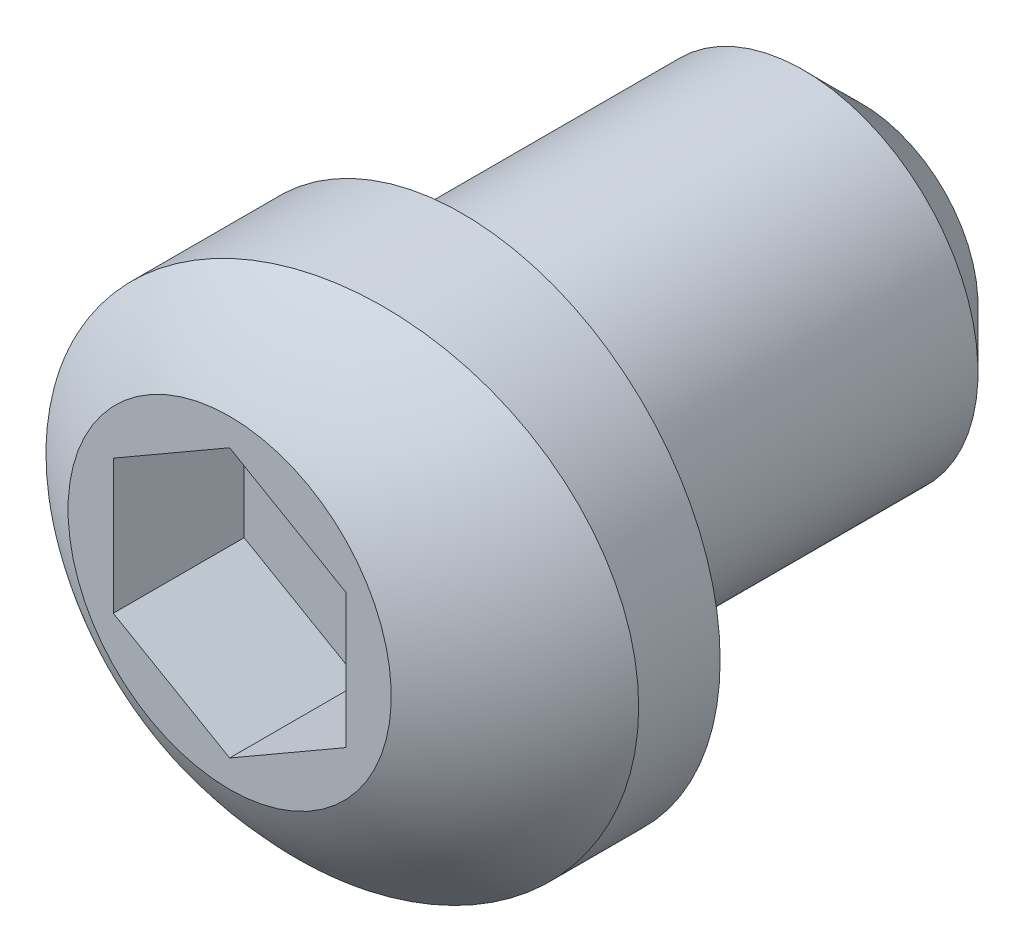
ISO-10303-21;
HEADER;
FILE_DESCRIPTION(('STEP AP214'),'2;1');
FILE_NAME('part.step','',(''),(''),'','','');
FILE_SCHEMA(('AUTOMOTIVE_DESIGN { 1 0 10303 214 1 1 1 1 }'));
ENDSEC;
DATA;
#1=APPLICATION_CONTEXT('core data for automotive mechanical design processes');
#2=APPLICATION_PROTOCOL_DEFINITION('international standard','automotive_design',2000,#1);
#3=PRODUCT_CONTEXT('',#1,'mechanical');
#4=PRODUCT('Part','Part','',(#3));
#5=PRODUCT_RELATED_PRODUCT_CATEGORY('part','',(#4));
#6=PRODUCT_DEFINITION_FORMATION('','',#4);
#7=PRODUCT_DEFINITION_CONTEXT('part definition',#1,'design');
#8=PRODUCT_DEFINITION('design','',#6,#7);
#9=PRODUCT_DEFINITION_SHAPE('','',#8);
#10=(LENGTH_UNIT() NAMED_UNIT(*) SI_UNIT(.MILLI.,.METRE.));
#11=(NAMED_UNIT(*) PLANE_ANGLE_UNIT() SI_UNIT($,.RADIAN.));
#12=(NAMED_UNIT(*) SI_UNIT($,.STERADIAN.) SOLID_ANGLE_UNIT());
#13=UNCERTAINTY_MEASURE_WITH_UNIT(LENGTH_MEASURE(1.E-05),#10,'distance_accuracy_value','');
#14=(GEOMETRIC_REPRESENTATION_CONTEXT(3) GLOBAL_UNCERTAINTY_ASSIGNED_CONTEXT((#13)) GLOBAL_UNIT_ASSIGNED_CONTEXT((#10,
#11,#12)) REPRESENTATION_CONTEXT('',''));
#15=CARTESIAN_POINT('',(0.,0.,0.));
#16=DIRECTION('',(0.,0.,1.));
#17=DIRECTION('',(1.,0.,0.));
#18=AXIS2_PLACEMENT_3D('',#15,#16,#17);
#19=CARTESIAN_POINT('',(0.,0.,-4.37516087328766));
#20=DIRECTION('',(0.,0.,1.));
#21=DIRECTION('',(0.,-1.,0.));
#22=AXIS2_PLACEMENT_3D('',#19,#20,#21);
#23=SPHERICAL_SURFACE('',#22,12.4184831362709);
#24=CARTESIAN_POINT('',(0.,0.,6.731));
#25=DIRECTION('',(0.,0.,1.));
#26=DIRECTION('',(-1.,0.,0.));
#27=AXIS2_PLACEMENT_3D('',#24,#25,#26);
#28=CIRCLE('',#27,5.55625);
#29=CARTESIAN_POINT('',(0.,-5.55625,6.731));
#30=VERTEX_POINT('',#29);
#31=EDGE_CURVE('E133',#30,#30,#28,.T.);
#32=CARTESIAN_POINT('',(7.48506717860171,6.32092343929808,3.25624919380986));
#33=CARTESIAN_POINT('',(7.30574546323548,6.49724383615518,3.28609149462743));
#34=CARTESIAN_POINT('',(7.11902177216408,6.66582353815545,3.31699013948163));
#35=CARTESIAN_POINT('',(6.7320528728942,6.98643352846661,3.38061683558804));
#36=CARTESIAN_POINT('',(6.53180370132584,7.13845893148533,3.41334542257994));
#37=CARTESIAN_POINT('',(6.11905439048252,7.42502558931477,3.48036050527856));
#38=CARTESIAN_POINT('',(5.90653995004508,7.5595458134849,3.51464880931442));
#39=CARTESIAN_POINT('',(5.47100369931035,7.8099810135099,3.58444707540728));
#40=CARTESIAN_POINT('',(5.24798168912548,7.92589563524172,3.61995706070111));
#41=CARTESIAN_POINT('',(4.79322257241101,8.13824042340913,3.69187059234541));
#42=CARTESIAN_POINT('',(4.56149302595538,8.23468704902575,3.72827335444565));
#43=CARTESIAN_POINT('',(4.09077897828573,8.40756831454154,3.80171261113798));
#44=CARTESIAN_POINT('',(3.85179435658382,8.48400262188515,3.83874911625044));
#45=CARTESIAN_POINT('',(3.36837048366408,8.61630701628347,3.91315697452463));
#46=CARTESIAN_POINT('',(3.12393377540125,8.67218648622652,3.95052816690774));
#47=CARTESIAN_POINT('',(2.63113219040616,8.76306181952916,4.02536382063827));
#48=CARTESIAN_POINT('',(2.38276596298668,8.79805033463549,4.06282831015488));
#49=CARTESIAN_POINT('',(1.88280237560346,8.84697581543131,4.13774590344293));
#50=CARTESIAN_POINT('',(1.63119546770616,8.86081653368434,4.17519818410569));
#51=CARTESIAN_POINT('',(1.12753709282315,8.86703411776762,4.24968311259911));
#52=CARTESIAN_POINT('',(0.875485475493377,8.85940119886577,4.28671556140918));
#53=CARTESIAN_POINT('',(0.372834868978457,8.82268284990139,4.36010307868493));
#54=CARTESIAN_POINT('',(0.122235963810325,8.79359619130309,4.39645810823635));
#55=CARTESIAN_POINT('',(-0.375585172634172,8.71416588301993,4.46824143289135));
#56=CARTESIAN_POINT('',(-0.622808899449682,8.66383198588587,4.50367014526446));
#57=CARTESIAN_POINT('',(-1.11210385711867,8.54226151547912,4.57338362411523));
#58=CARTESIAN_POINT('',(-1.35417742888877,8.4710346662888,4.60766891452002));
#59=CARTESIAN_POINT('',(-1.8314527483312,8.30816947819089,4.67489491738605));
#60=CARTESIAN_POINT('',(-2.06665692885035,8.21653846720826,4.7078361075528));
#61=CARTESIAN_POINT('',(-2.52860665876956,8.01345063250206,4.77219869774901));
#62=CARTESIAN_POINT('',(-2.7553508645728,7.90199067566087,4.80361985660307));
#63=CARTESIAN_POINT('',(-3.19867480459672,7.66001628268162,4.86475572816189));
#64=CARTESIAN_POINT('',(-3.4152545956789,7.52950195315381,4.89447045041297));
#65=CARTESIAN_POINT('',(-3.83526291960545,7.25123896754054,4.95183626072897));
#66=CARTESIAN_POINT('',(-4.03876840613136,7.10360898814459,4.97949960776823));
#67=CARTESIAN_POINT('',(-4.432665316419,6.7914570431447,5.03282356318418));
#68=CARTESIAN_POINT('',(-4.62305678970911,6.62693514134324,5.05848417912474));
#69=CARTESIAN_POINT('',(-4.98930428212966,6.28215673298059,5.10766190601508));
#70=CARTESIAN_POINT('',(-5.16516082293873,6.10190079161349,5.13117909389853));
#71=CARTESIAN_POINT('',(-5.50102820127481,5.72692434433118,5.17594393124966));
#72=CARTESIAN_POINT('',(-5.66103913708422,5.53220392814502,5.19719159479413));
#73=CARTESIAN_POINT('',(-5.96265693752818,5.13148451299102,5.23712470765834));
#74=CARTESIAN_POINT('',(-6.10441512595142,4.92560150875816,5.25583130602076));
#75=CARTESIAN_POINT('',(-6.3701226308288,4.50245176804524,5.29080558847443));
#76=CARTESIAN_POINT('',(-6.49407210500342,4.28518513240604,5.30707329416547));
#77=CARTESIAN_POINT('',(-6.72322799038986,3.84082411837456,5.3370847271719));
#78=CARTESIAN_POINT('',(-6.8284350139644,3.61373006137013,5.35082853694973));
#79=CARTESIAN_POINT('',(-7.01931592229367,3.15133844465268,5.37572153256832));
#80=CARTESIAN_POINT('',(-7.10498989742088,2.91604092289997,5.38687073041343));
#81=CARTESIAN_POINT('',(-7.25555500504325,2.44083489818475,5.40643894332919));
#82=CARTESIAN_POINT('',(-7.32060555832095,2.20097775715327,5.41487890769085));
#83=CARTESIAN_POINT('',(-7.43035461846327,1.71657617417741,5.42910562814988));
#84=CARTESIAN_POINT('',(-7.47505334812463,1.47203178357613,5.4348924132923));
#85=CARTESIAN_POINT('',(-7.5437626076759,0.980011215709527,5.44378342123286));
#86=CARTESIAN_POINT('',(-7.56777361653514,0.732535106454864,5.4468877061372));
#87=CARTESIAN_POINT('',(-7.5949283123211,0.236421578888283,5.45039820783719));
#88=CARTESIAN_POINT('',(-7.59807203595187,-0.0122158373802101,5.45080442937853));
#89=CARTESIAN_POINT('',(-7.58350264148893,-0.507711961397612,5.44892116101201));
#90=CARTESIAN_POINT('',(-7.56588628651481,-0.754573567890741,5.44664417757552));
#91=CARTESIAN_POINT('',(-7.51007833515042,-1.24600712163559,5.43942532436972));
#92=CARTESIAN_POINT('',(-7.47187964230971,-1.49057824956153,5.43448253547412));
#93=CARTESIAN_POINT('',(-7.37519663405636,-1.97555954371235,5.42195752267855));
#94=CARTESIAN_POINT('',(-7.31671619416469,-2.21597049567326,5.4143758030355));
#95=CARTESIAN_POINT('',(-7.17990200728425,-2.69098099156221,5.39661072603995));
#96=CARTESIAN_POINT('',(-7.10156789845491,-2.92558042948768,5.38642732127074));
#97=CARTESIAN_POINT('',(-6.9256085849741,-3.38735834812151,5.36350778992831));
#98=CARTESIAN_POINT('',(-6.82797921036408,-3.61453521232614,5.35077111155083));
#99=CARTESIAN_POINT('',(-6.61415874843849,-4.05982462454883,5.32281050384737));
#100=CARTESIAN_POINT('',(-6.49796726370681,-4.27793697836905,5.30758652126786));
#101=CARTESIAN_POINT('',(-6.24789922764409,-4.7035338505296,5.27473156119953));
#102=CARTESIAN_POINT('',(-6.11402573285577,-4.91102019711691,5.2571009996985));
#103=CARTESIAN_POINT('',(-5.82950618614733,-5.31403901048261,5.21951416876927));
#104=CARTESIAN_POINT('',(-5.67885431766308,-5.5095672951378,5.19955709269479));
#105=CARTESIAN_POINT('',(-5.36117018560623,-5.8881284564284,5.1573262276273));
#106=CARTESIAN_POINT('',(-5.19406492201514,-6.07109891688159,5.1350420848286));
#107=CARTESIAN_POINT('',(-4.84527754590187,-6.42228636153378,5.08835010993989));
#108=CARTESIAN_POINT('',(-4.66359508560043,-6.59050299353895,5.06394222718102));
#109=CARTESIAN_POINT('',(-4.28696641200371,-6.91103503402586,5.01313131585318));
#110=CARTESIAN_POINT('',(-4.09202013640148,-7.0633503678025,4.98672827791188));
#111=CARTESIAN_POINT('',(-3.69025509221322,-7.35105793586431,4.93206669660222));
#112=CARTESIAN_POINT('',(-3.48343599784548,-7.48644970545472,4.90380810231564));
#113=CARTESIAN_POINT('',(-3.05772356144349,-7.74040412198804,4.84535802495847));
#114=CARTESIAN_POINT('',(-2.8387478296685,-7.85882556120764,4.81515305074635));
#115=CARTESIAN_POINT('',(-2.39172568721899,-8.0768035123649,4.75317052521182));
#116=CARTESIAN_POINT('',(-2.16367633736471,-8.1763538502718,4.72139246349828));
#117=CARTESIAN_POINT('',(-1.70022242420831,-8.35587568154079,4.65645631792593));
#118=CARTESIAN_POINT('',(-1.46481879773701,-8.43584965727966,4.62329840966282));
#119=CARTESIAN_POINT('',(-0.988286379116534,-8.57571797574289,4.55578963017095));
#120=CARTESIAN_POINT('',(-0.747157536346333,-8.63561214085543,4.52143874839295));
#121=CARTESIAN_POINT('',(-0.258679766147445,-8.73538597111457,4.45143375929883));
#122=CARTESIAN_POINT('',(-0.0112944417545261,-8.77508123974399,4.41577072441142));
#123=CARTESIAN_POINT('',(0.485754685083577,-8.83338485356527,4.34366774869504));
#124=CARTESIAN_POINT('',(0.735417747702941,-8.85199981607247,4.30722805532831));
#125=CARTESIAN_POINT('',(1.23539359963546,-8.86806104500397,4.23378442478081));
#126=CARTESIAN_POINT('',(1.48570651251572,-8.86550293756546,4.19678037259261));
#127=CARTESIAN_POINT('',(1.98516826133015,-8.83924232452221,4.12245900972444));
#128=CARTESIAN_POINT('',(2.23431711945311,-8.81554022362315,4.08514170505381));
#129=CARTESIAN_POINT('',(2.73128579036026,-8.74694780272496,4.01020953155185));
#130=CARTESIAN_POINT('',(2.9790871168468,-8.70192389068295,3.97259427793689));
#131=CARTESIAN_POINT('',(3.4699884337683,-8.59095501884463,3.8975730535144));
#132=CARTESIAN_POINT('',(3.71308849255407,-8.52501036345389,3.86016707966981));
#133=CARTESIAN_POINT('',(4.19291431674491,-8.3726387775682,3.78583596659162));
#134=CARTESIAN_POINT('',(4.42963877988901,-8.28620769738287,3.74891092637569));
#135=CARTESIAN_POINT('',(4.89489283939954,-8.09349508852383,3.67585126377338));
#136=CARTESIAN_POINT('',(5.12342527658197,-7.98722052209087,3.63971636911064));
#137=CARTESIAN_POINT('',(5.57090706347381,-7.75544115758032,3.56849416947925));
#138=CARTESIAN_POINT('',(5.78984936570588,-7.62992251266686,3.53340764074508));
#139=CARTESIAN_POINT('',(6.21638668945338,-7.3605713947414,3.46461280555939));
#140=CARTESIAN_POINT('',(6.42398195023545,-7.21673930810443,3.43090447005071));
#141=CARTESIAN_POINT('',(6.82631515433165,-6.91174499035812,3.36517052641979));
#142=CARTESIAN_POINT('',(7.02105297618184,-6.75058259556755,3.33314493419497));
#143=CARTESIAN_POINT('',(7.39622385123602,-6.4120473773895,3.27108296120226));
#144=CARTESIAN_POINT('',(7.57665730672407,-6.23467501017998,3.24104652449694));
#145=CARTESIAN_POINT('',(7.92066370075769,-5.86624925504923,3.18346518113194));
#146=CARTESIAN_POINT('',(8.0843457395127,-5.67530023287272,3.15590431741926));
#147=CARTESIAN_POINT('',(8.39499093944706,-5.28003753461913,3.10333524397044));
#148=CARTESIAN_POINT('',(8.54196018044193,-5.07572876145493,3.0783261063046));
#149=CARTESIAN_POINT('',(8.81814563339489,-4.65509835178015,3.03111740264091));
#150=CARTESIAN_POINT('',(8.94735958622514,-4.43877519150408,3.00891819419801));
#151=CARTESIAN_POINT('',(9.18701075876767,-3.99568662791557,2.96758455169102));
#152=CARTESIAN_POINT('',(9.29744816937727,-3.76892133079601,2.94845008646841));
#153=CARTESIAN_POINT('',(9.49736117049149,-3.30961784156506,2.91369988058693));
#154=CARTESIAN_POINT('',(9.58709214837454,-3.07719402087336,2.89804137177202));
#155=CARTESIAN_POINT('',(9.74672396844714,-2.60543502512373,2.87011390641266));
#156=CARTESIAN_POINT('',(9.81662497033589,-2.36609990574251,2.85784492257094));
#157=CARTESIAN_POINT('',(9.93604121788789,-1.88227099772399,2.83684689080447));
#158=CARTESIAN_POINT('',(9.98555862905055,-1.63777775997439,2.82811746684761));
#159=CARTESIAN_POINT('',(10.0638251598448,-1.14538805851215,2.81430518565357));
#160=CARTESIAN_POINT('',(10.0925744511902,-0.897491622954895,2.80922229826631));
#161=CARTESIAN_POINT('',(10.1288515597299,-0.403168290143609,2.80280662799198));
#162=CARTESIAN_POINT('',(10.136635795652,-0.15676076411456,2.80142853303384));
#163=CARTESIAN_POINT('',(10.1316597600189,0.335839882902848,2.80230906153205));
#164=CARTESIAN_POINT('',(10.1188995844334,0.582033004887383,2.80456766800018));
#165=CARTESIAN_POINT('',(10.0729291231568,1.07249892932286,2.81269462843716));
#166=CARTESIAN_POINT('',(10.039714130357,1.31677127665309,2.81856381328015));
#167=CARTESIAN_POINT('',(9.95308925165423,1.8015915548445,2.83384056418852));
#168=CARTESIAN_POINT('',(9.89967967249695,2.04213954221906,2.84324807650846));
#169=CARTESIAN_POINT('',(9.77324193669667,2.51719485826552,2.86545916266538));
#170=CARTESIAN_POINT('',(9.70026475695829,2.75171617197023,2.87825391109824));
#171=CARTESIAN_POINT('',(9.53518772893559,3.21371750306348,2.90709984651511));
#172=CARTESIAN_POINT('',(9.44308808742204,3.44119759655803,2.92315099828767));
#173=CARTESIAN_POINT('',(9.24056204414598,3.88731474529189,2.95830836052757));
#174=CARTESIAN_POINT('',(9.13015497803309,4.10596083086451,2.97741134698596));
#175=CARTESIAN_POINT('',(8.89180549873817,4.53310349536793,3.01846647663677));
#176=CARTESIAN_POINT('',(8.76386763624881,4.74160268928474,3.04041788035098));
#177=CARTESIAN_POINT('',(8.46081638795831,5.19255897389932,3.09215636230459));
#178=CARTESIAN_POINT('',(8.28155398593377,5.43216748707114,3.12259741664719));
#179=CARTESIAN_POINT('',(7.90002084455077,5.89178804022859,3.1869467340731));
#180=CARTESIAN_POINT('',(7.69775017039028,6.11180013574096,3.22085498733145));
#181=CARTESIAN_POINT('',(7.48506717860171,6.32092343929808,3.25624919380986));
#182=B_SPLINE_CURVE_WITH_KNOTS('',3,(#32,#33,#34,#35,#36,#37,#38,#39,#40,#41,#42,#43,#44,#45,
#46,#47,#48,#49,#50,#51,#52,#53,#54,#55,#56,#57,#58,#59,#60,#61,#62,#63,#64,#65,#66,#67,#68,#69,
#70,#71,#72,#73,#74,#75,#76,#77,#78,#79,#80,#81,#82,#83,#84,#85,#86,#87,#88,#89,#90,#91,#92,#93,
#94,#95,#96,#97,#98,#99,#100,#101,#102,#103,#104,#105,#106,#107,#108,#109,#110,#111,#112,#113,
#114,#115,#116,#117,#118,#119,#120,#121,#122,#123,#124,#125,#126,#127,#128,#129,#130,#131,#132,
#133,#134,#135,#136,#137,#138,#139,#140,#141,#142,#143,#144,#145,#146,#147,#148,#149,#150,#151,
#152,#153,#154,#155,#156,#157,#158,#159,#160,#161,#162,#163,#164,#165,#166,#167,#168,#169,#170,
#171,#172,#173,#174,#175,#176,#177,#178,#179,#180,#181),.UNSPECIFIED.,.T.,.F.,(4,2,2,2,2,2,2,2,
2,2,2,2,2,2,2,2,2,2,2,2,2,2,2,2,2,2,2,2,2,2,2,2,2,2,2,2,2,2,2,2,2,2,2,2,2,2,2,2,2,2,2,2,2,2,2,2,
2,2,2,2,2,2,2,2,2,2,2,2,2,2,2,2,2,2,4),(0.,0.759483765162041,1.5191910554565,2.27980278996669,
3.04042899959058,3.80040942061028,4.56040246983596,5.32004816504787,6.07996090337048,
6.84332194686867,7.60703088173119,8.37078355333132,9.134186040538,9.89723378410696,
10.6600079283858,11.4229027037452,12.1857932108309,12.9436790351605,13.7015619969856,
14.4594177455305,15.2172687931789,15.9683651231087,16.7194548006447,17.4705199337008,
18.2215815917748,18.9666873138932,19.7117848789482,20.4568651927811,21.2019441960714,
21.9435640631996,22.6854397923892,23.4271738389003,24.168921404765,24.9108294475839,
25.6527533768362,26.3945492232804,27.1366030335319,27.8821117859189,28.6276383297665,
29.3731683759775,30.1187188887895,30.8701516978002,31.6218299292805,32.373412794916,
33.1250023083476,33.8833352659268,34.6414301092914,35.3996815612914,36.1579185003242,
36.9209703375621,37.6840110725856,38.4472064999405,39.2101346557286,39.9736143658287,
40.7370779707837,41.5005487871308,42.2639981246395,43.0221076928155,43.7799405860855,
44.5378698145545,45.2957913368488,46.0437950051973,46.7917926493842,47.539710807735,
48.2876227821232,49.0263447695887,49.7650633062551,50.5039519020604,51.2428292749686,
51.9798001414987,52.7167630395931,53.4529524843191,54.1889511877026,55.0897329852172,
55.9905122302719),.UNSPECIFIED.);
#183=CARTESIAN_POINT('',(0.,-8.77315411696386,4.41406493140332));
#184=VERTEX_POINT('',#183);
#185=EDGE_CURVE('E125',#184,#184,#182,.T.);
#186=CARTESIAN_POINT('',(0.,-5.55625,6.731));
#187=CARTESIAN_POINT('',(0.,-5.59334078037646,6.71244403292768));
#188=CARTESIAN_POINT('',(0.,-5.63033859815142,6.69370224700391));
#189=CARTESIAN_POINT('',(0.,-5.70414460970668,6.65584894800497));
#190=CARTESIAN_POINT('',(0.,-5.74095280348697,6.6367374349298));
#191=CARTESIAN_POINT('',(0.,-5.81437586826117,6.59814659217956));
#192=CARTESIAN_POINT('',(0.,-5.85099073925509,6.57866726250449));
#193=CARTESIAN_POINT('',(0.,-5.92402348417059,6.53934274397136));
#194=CARTESIAN_POINT('',(0.,-5.96044135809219,6.5194975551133));
#195=CARTESIAN_POINT('',(0.,-6.03307645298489,6.4794433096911));
#196=CARTESIAN_POINT('',(0.,-6.06929367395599,6.45923425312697));
#197=CARTESIAN_POINT('',(0.,-6.14152382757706,6.41845430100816));
#198=CARTESIAN_POINT('',(0.,-6.17753676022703,6.39788340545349));
#199=CARTESIAN_POINT('',(0.,-6.2493547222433,6.3563818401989));
#200=CARTESIAN_POINT('',(0.,-6.28515975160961,6.33545117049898));
#201=CARTESIAN_POINT('',(0.,-6.35655831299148,6.29323215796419));
#202=CARTESIAN_POINT('',(0.,-6.39215184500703,6.27194381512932));
#203=CARTESIAN_POINT('',(0.,-6.46312383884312,6.22901159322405));
#204=CARTESIAN_POINT('',(0.,-6.49850230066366,6.20736771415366));
#205=CARTESIAN_POINT('',(0.,-6.56904060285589,6.16372659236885));
#206=CARTESIAN_POINT('',(0.,-6.60420044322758,6.14172934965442));
#207=CARTESIAN_POINT('',(0.,-6.67429797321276,6.09738370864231));
#208=CARTESIAN_POINT('',(0.,-6.70923566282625,6.07503531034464));
#209=CARTESIAN_POINT('',(0.,-6.77888538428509,6.02998960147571));
#210=CARTESIAN_POINT('',(0.,-6.81359741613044,6.00729229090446));
#211=CARTESIAN_POINT('',(0.,-6.88279233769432,5.96155103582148));
#212=CARTESIAN_POINT('',(0.,-6.91727522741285,5.93850709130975));
#213=CARTESIAN_POINT('',(0.,-6.98600840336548,5.89207488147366));
#214=CARTESIAN_POINT('',(0.,-7.02025868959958,5.8686866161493));
#215=CARTESIAN_POINT('',(0.,-7.08852322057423,5.8215681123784));
#216=CARTESIAN_POINT('',(0.,-7.12253746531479,5.79783787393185));
#217=CARTESIAN_POINT('',(0.,-7.19032649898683,5.75003780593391));
#218=CARTESIAN_POINT('',(0.,-7.22410128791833,5.72596797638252));
#219=CARTESIAN_POINT('',(0.,-7.2914080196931,5.67749114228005));
#220=CARTESIAN_POINT('',(0.,-7.32493996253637,5.65308413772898));
#221=CARTESIAN_POINT('',(0.,-7.39175763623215,5.60393540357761));
#222=CARTESIAN_POINT('',(0.,-7.42504336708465,5.5791936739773));
#223=CARTESIAN_POINT('',(0.,-7.49136527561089,5.52937797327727));
#224=CARTESIAN_POINT('',(0.,-7.52440145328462,5.50430400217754));
#225=CARTESIAN_POINT('',(0.,-7.59022093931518,5.45382633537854));
#226=CARTESIAN_POINT('',(0.,-7.62300424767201,5.42842263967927));
#227=CARTESIAN_POINT('',(0.,-7.68831470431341,5.37728807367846));
#228=CARTESIAN_POINT('',(0.,-7.72084185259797,5.35155720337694));
#229=CARTESIAN_POINT('',(0.,-7.78563672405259,5.2997708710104));
#230=CARTESIAN_POINT('',(0.,-7.81790444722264,5.27371540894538));
#231=CARTESIAN_POINT('',(0.,-7.88217722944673,5.22128250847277));
#232=CARTESIAN_POINT('',(0.,-7.91418228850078,5.19490507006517));
#233=CARTESIAN_POINT('',(0.,-7.97792652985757,5.14183086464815));
#234=CARTESIAN_POINT('',(0.,-8.00966571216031,5.11513409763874));
#235=CARTESIAN_POINT('',(0.,-8.07287501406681,5.06142391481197));
#236=CARTESIAN_POINT('',(0.,-8.10434513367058,5.03441049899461));
#237=CARTESIAN_POINT('',(0.,-8.16701315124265,4.98006973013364));
#238=CARTESIAN_POINT('',(0.,-8.19821104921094,4.95274237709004));
#239=CARTESIAN_POINT('',(0.,-8.26033149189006,4.89777647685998));
#240=CARTESIAN_POINT('',(0.,-8.29125403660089,4.87013792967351));
#241=CARTESIAN_POINT('',(0.,-8.35282066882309,4.81455241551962));
#242=CARTESIAN_POINT('',(0.,-8.38346475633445,4.78660544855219));
#243=CARTESIAN_POINT('',(0.,-8.44447139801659,4.73040590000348));
#244=CARTESIAN_POINT('',(0.,-8.47483395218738,4.70215331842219));
#245=CARTESIAN_POINT('',(0.,-8.53527447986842,4.64534537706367));
#246=CARTESIAN_POINT('',(0.,-8.56535245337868,4.61679001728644));
#247=CARTESIAN_POINT('',(0.,-8.62522079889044,4.55937938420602));
#248=CARTESIAN_POINT('',(0.,-8.65501117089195,4.53052411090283));
#249=CARTESIAN_POINT('',(0.,-8.71430132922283,4.47251655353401));
#250=CARTESIAN_POINT('',(0.,-8.74380111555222,4.44336426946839));
#251=CARTESIAN_POINT('',(0.,-8.77315411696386,4.41406493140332));
#252=B_SPLINE_CURVE_WITH_KNOTS('',3,(#186,#187,#188,#189,#190,#191,#192,#193,#194,#195,#196,
#197,#198,#199,#200,#201,#202,#203,#204,#205,#206,#207,#208,#209,#210,#211,#212,#213,#214,#215,
#216,#217,#218,#219,#220,#221,#222,#223,#224,#225,#226,#227,#228,#229,#230,#231,#232,#233,#234,
#235,#236,#237,#238,#239,#240,#241,#242,#243,#244,#245,#246,#247,#248,#249,#250,#251),
.UNSPECIFIED.,.F.,.F.,(4,2,2,2,2,2,2,2,2,2,2,2,2,2,2,2,2,2,2,2,2,2,2,2,2,2,2,2,2,2,2,2,4),(0.,
0.124419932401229,0.248839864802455,0.373259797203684,0.497679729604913,0.622099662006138,
0.746519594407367,0.870939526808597,0.995359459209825,1.11977939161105,1.24419932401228,
1.36861925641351,1.49303918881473,1.61745912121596,1.74187905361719,1.86629898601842,
1.99071891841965,2.11513885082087,2.2395587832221,2.36397871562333,2.48839864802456,
2.61281858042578,2.73723851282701,2.86165844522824,2.98607837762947,3.1104983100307,
3.23491824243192,3.35933817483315,3.48375810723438,3.60817803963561,3.73259797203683,
3.85701790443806,3.98143783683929),.UNSPECIFIED.);
#253=EDGE_CURVE('BSEAM14',#30,#184,#252,.T.);
#254=ORIENTED_EDGE('',*,*,#31,.F.);
#255=ORIENTED_EDGE('',*,*,#185,.T.);
#256=ORIENTED_EDGE('',*,*,#253,.T.);
#257=ORIENTED_EDGE('',*,*,#253,.F.);
#258=EDGE_LOOP('',(#254,#256,#255,#257));
#259=FACE_BOUND('',#258,.T.);
#260=ADVANCED_FACE('F14',(#259),#23,.T.);
#261=CARTESIAN_POINT('',(0.,0.,6.731));
#262=DIRECTION('',(0.,0.,1.));
#263=DIRECTION('',(-1.,0.,0.));
#264=AXIS2_PLACEMENT_3D('',#261,#262,#263);
#265=PLANE('',#264);
#266=DIRECTION('',(0.866025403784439,-0.5,0.));
#267=VECTOR('',#266,1.);
#268=CARTESIAN_POINT('',(-4.,-2.30940107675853,6.731));
#269=LINE('',#268,#267);
#270=CARTESIAN_POINT('',(-4.,-2.30940107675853,6.731));
#271=VERTEX_POINT('',#270);
#272=CARTESIAN_POINT('',(0.,-4.61880215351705,6.731));
#273=VERTEX_POINT('',#272);
#274=EDGE_CURVE('E29',#271,#273,#269,.T.);
#275=ORIENTED_EDGE('',*,*,#274,.F.);
#276=DIRECTION('',(0.,-1.,0.));
#277=VECTOR('',#276,1.);
#278=CARTESIAN_POINT('',(-4.,2.30940107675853,6.731));
#279=LINE('',#278,#277);
#280=CARTESIAN_POINT('',(-4.,2.30940107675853,6.731));
#281=VERTEX_POINT('',#280);
#282=EDGE_CURVE('E112',#281,#271,#279,.T.);
#283=ORIENTED_EDGE('',*,*,#282,.F.);
#284=DIRECTION('',(-0.866025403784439,-0.5,0.));
#285=VECTOR('',#284,1.);
#286=CARTESIAN_POINT('',(0.,4.61880215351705,6.731));
#287=LINE('',#286,#285);
#288=CARTESIAN_POINT('',(0.,4.61880215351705,6.731));
#289=VERTEX_POINT('',#288);
#290=EDGE_CURVE('E110',#289,#281,#287,.T.);
#291=ORIENTED_EDGE('',*,*,#290,.F.);
#292=DIRECTION('',(-0.866025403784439,0.5,0.));
#293=VECTOR('',#292,1.);
#294=CARTESIAN_POINT('',(4.,2.30940107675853,6.731));
#295=LINE('',#294,#293);
#296=CARTESIAN_POINT('',(4.,2.30940107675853,6.731));
#297=VERTEX_POINT('',#296);
#298=EDGE_CURVE('E77',#297,#289,#295,.T.);
#299=ORIENTED_EDGE('',*,*,#298,.F.);
#300=DIRECTION('',(0.,1.,0.));
#301=VECTOR('',#300,1.);
#302=CARTESIAN_POINT('',(4.,-2.30940107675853,6.731));
#303=LINE('',#302,#301);
#304=CARTESIAN_POINT('',(4.,-2.30940107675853,6.731));
#305=VERTEX_POINT('',#304);
#306=EDGE_CURVE('E106',#305,#297,#303,.T.);
#307=ORIENTED_EDGE('',*,*,#306,.F.);
#308=DIRECTION('',(0.866025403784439,0.5,0.));
#309=VECTOR('',#308,1.);
#310=CARTESIAN_POINT('',(0.,-4.61880215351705,6.731));
#311=LINE('',#310,#309);
#312=EDGE_CURVE('E103',#273,#305,#311,.T.);
#313=ORIENTED_EDGE('',*,*,#312,.F.);
#314=EDGE_LOOP('',(#275,#283,#291,#299,#307,#313));
#315=FACE_BOUND('',#314,.T.);
#316=ORIENTED_EDGE('',*,*,#31,.T.);
#317=EDGE_LOOP('',(#316));
#318=FACE_BOUND('',#317,.T.);
#319=ADVANCED_FACE('F142',(#315,#318),#265,.T.);
#320=CARTESIAN_POINT('',(1.27,0.,-3.429));
#321=DIRECTION('',(0.,0.,1.));
#322=DIRECTION('',(-1.,0.,0.));
#323=AXIS2_PLACEMENT_3D('',#320,#321,#322);
#324=CYLINDRICAL_SURFACE('',#323,8.8646);
#325=ORIENTED_EDGE('',*,*,#185,.F.);
#326=EDGE_LOOP('',(#325));
#327=FACE_BOUND('',#326,.T.);
#328=CARTESIAN_POINT('',(1.27,0.,0.));
#329=DIRECTION('',(0.,0.,1.));
#330=DIRECTION('',(-1.,0.,0.));
#331=AXIS2_PLACEMENT_3D('',#328,#329,#330);
#332=CIRCLE('',#331,8.8646);
#333=CARTESIAN_POINT('',(-7.5946,0.,0.));
#334=VERTEX_POINT('',#333);
#335=EDGE_CURVE('E124',#334,#334,#332,.T.);
#336=ORIENTED_EDGE('',*,*,#335,.T.);
#337=EDGE_LOOP('',(#336));
#338=FACE_BOUND('',#337,.T.);
#339=ADVANCED_FACE('F137',(#327,#338),#324,.T.);
#340=CARTESIAN_POINT('',(0.,-6.35,0.));
#341=DIRECTION('',(0.,0.,1.));
#342=DIRECTION('',(-1.,0.,0.));
#343=AXIS2_PLACEMENT_3D('',#340,#341,#342);
#344=PLANE('',#343);
#345=ORIENTED_EDGE('',*,*,#335,.F.);
#346=EDGE_LOOP('',(#345));
#347=FACE_BOUND('',#346,.T.);
#348=CARTESIAN_POINT('',(0.,0.,0.));
#349=DIRECTION('',(0.,0.,1.));
#350=DIRECTION('',(-1.,0.,0.));
#351=AXIS2_PLACEMENT_3D('',#348,#349,#350);
#352=CIRCLE('',#351,6.);
#353=CARTESIAN_POINT('',(-6.,0.,0.));
#354=VERTEX_POINT('',#353);
#355=EDGE_CURVE('E116',#354,#354,#352,.F.);
#356=ORIENTED_EDGE('',*,*,#355,.F.);
#357=EDGE_LOOP('',(#356));
#358=FACE_BOUND('',#357,.T.);
#359=ADVANCED_FACE('F141',(#347,#358),#344,.F.);
#360=CARTESIAN_POINT('',(0.,0.,38.673401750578));
#361=DIRECTION('',(0.,0.,-1.));
#362=DIRECTION('',(1.,0.,0.));
#363=AXIS2_PLACEMENT_3D('',#360,#361,#362);
#364=CYLINDRICAL_SURFACE('',#363,6.);
#365=CARTESIAN_POINT('',(0.,0.,-13.));
#366=DIRECTION('',(0.,0.,-1.));
#367=DIRECTION('',(-1.,0.,0.));
#368=AXIS2_PLACEMENT_3D('',#365,#366,#367);
#369=CIRCLE('',#368,6.);
#370=CARTESIAN_POINT('',(-6.,0.,-13.));
#371=VERTEX_POINT('',#370);
#372=EDGE_CURVE('E9',#371,#371,#369,.F.);
#373=ORIENTED_EDGE('',*,*,#372,.T.);
#374=EDGE_LOOP('',(#373));
#375=FACE_BOUND('',#374,.T.);
#376=ORIENTED_EDGE('',*,*,#355,.T.);
#377=EDGE_LOOP('',(#376));
#378=FACE_BOUND('',#377,.T.);
#379=ADVANCED_FACE('F144',(#375,#378),#364,.T.);
#380=CARTESIAN_POINT('',(-4.,-2.30940107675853,2.231));
#381=DIRECTION('',(-0.5,-0.866025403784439,0.));
#382=DIRECTION('',(0.866025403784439,-0.5,0.));
#383=AXIS2_PLACEMENT_3D('',#380,#381,#382);
#384=PLANE('',#383);
#385=ORIENTED_EDGE('',*,*,#274,.T.);
#386=DIRECTION('',(0.,0.,1.));
#387=VECTOR('',#386,1.);
#388=CARTESIAN_POINT('',(0.,-4.61880215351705,2.231));
#389=LINE('',#388,#387);
#390=CARTESIAN_POINT('',(0.,-4.61880215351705,2.231));
#391=VERTEX_POINT('',#390);
#392=EDGE_CURVE('E59',#391,#273,#389,.T.);
#393=ORIENTED_EDGE('',*,*,#392,.F.);
#394=DIRECTION('',(0.866025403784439,-0.5,0.));
#395=VECTOR('',#394,1.);
#396=CARTESIAN_POINT('',(-4.,-2.30940107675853,2.231));
#397=LINE('',#396,#395);
#398=CARTESIAN_POINT('',(-4.,-2.30940107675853,2.231));
#399=VERTEX_POINT('',#398);
#400=EDGE_CURVE('E114',#399,#391,#397,.T.);
#401=ORIENTED_EDGE('',*,*,#400,.F.);
#402=DIRECTION('',(0.,0.,1.));
#403=VECTOR('',#402,1.);
#404=CARTESIAN_POINT('',(-4.,-2.30940107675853,2.231));
#405=LINE('',#404,#403);
#406=EDGE_CURVE('E37',#399,#271,#405,.T.);
#407=ORIENTED_EDGE('',*,*,#406,.T.);
#408=EDGE_LOOP('',(#385,#393,#401,#407));
#409=FACE_BOUND('',#408,.T.);
#410=ADVANCED_FACE('F153',(#409),#384,.F.);
#411=CARTESIAN_POINT('',(-4.,2.30940107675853,2.231));
#412=DIRECTION('',(-1.,0.,0.));
#413=DIRECTION('',(0.,0.,1.));
#414=AXIS2_PLACEMENT_3D('',#411,#412,#413);
#415=PLANE('',#414);
#416=ORIENTED_EDGE('',*,*,#282,.T.);
#417=ORIENTED_EDGE('',*,*,#406,.F.);
#418=DIRECTION('',(0.,-1.,0.));
#419=VECTOR('',#418,1.);
#420=CARTESIAN_POINT('',(-4.,2.30940107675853,2.231));
#421=LINE('',#420,#419);
#422=CARTESIAN_POINT('',(-4.,2.30940107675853,2.231));
#423=VERTEX_POINT('',#422);
#424=EDGE_CURVE('E89',#423,#399,#421,.T.);
#425=ORIENTED_EDGE('',*,*,#424,.F.);
#426=DIRECTION('',(0.,0.,1.));
#427=VECTOR('',#426,1.);
#428=CARTESIAN_POINT('',(-4.,2.30940107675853,2.231));
#429=LINE('',#428,#427);
#430=EDGE_CURVE('E81',#423,#281,#429,.T.);
#431=ORIENTED_EDGE('',*,*,#430,.T.);
#432=EDGE_LOOP('',(#416,#417,#425,#431));
#433=FACE_BOUND('',#432,.T.);
#434=ADVANCED_FACE('F193',(#433),#415,.F.);
#435=CARTESIAN_POINT('',(0.,4.61880215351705,2.231));
#436=DIRECTION('',(-0.5,0.866025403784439,0.));
#437=DIRECTION('',(-0.866025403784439,-0.5,0.));
#438=AXIS2_PLACEMENT_3D('',#435,#436,#437);
#439=PLANE('',#438);
#440=ORIENTED_EDGE('',*,*,#290,.T.);
#441=ORIENTED_EDGE('',*,*,#430,.F.);
#442=DIRECTION('',(-0.866025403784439,-0.5,0.));
#443=VECTOR('',#442,1.);
#444=CARTESIAN_POINT('',(0.,4.61880215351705,2.231));
#445=LINE('',#444,#443);
#446=CARTESIAN_POINT('',(0.,4.61880215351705,2.231));
#447=VERTEX_POINT('',#446);
#448=EDGE_CURVE('E85',#447,#423,#445,.T.);
#449=ORIENTED_EDGE('',*,*,#448,.F.);
#450=DIRECTION('',(0.,0.,1.));
#451=VECTOR('',#450,1.);
#452=CARTESIAN_POINT('',(0.,4.61880215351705,2.231));
#453=LINE('',#452,#451);
#454=EDGE_CURVE('E70',#447,#289,#453,.T.);
#455=ORIENTED_EDGE('',*,*,#454,.T.);
#456=EDGE_LOOP('',(#440,#441,#449,#455));
#457=FACE_BOUND('',#456,.T.);
#458=ADVANCED_FACE('F86',(#457),#439,.F.);
#459=CARTESIAN_POINT('',(4.,2.30940107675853,2.231));
#460=DIRECTION('',(0.5,0.866025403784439,0.));
#461=DIRECTION('',(-0.866025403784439,0.5,0.));
#462=AXIS2_PLACEMENT_3D('',#459,#460,#461);
#463=PLANE('',#462);
#464=ORIENTED_EDGE('',*,*,#298,.T.);
#465=ORIENTED_EDGE('',*,*,#454,.F.);
#466=DIRECTION('',(-0.866025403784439,0.5,0.));
#467=VECTOR('',#466,1.);
#468=CARTESIAN_POINT('',(4.,2.30940107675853,2.231));
#469=LINE('',#468,#467);
#470=CARTESIAN_POINT('',(4.,2.30940107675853,2.231));
#471=VERTEX_POINT('',#470);
#472=EDGE_CURVE('E74',#471,#447,#469,.T.);
#473=ORIENTED_EDGE('',*,*,#472,.F.);
#474=DIRECTION('',(0.,0.,1.));
#475=VECTOR('',#474,1.);
#476=CARTESIAN_POINT('',(4.,2.30940107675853,2.231));
#477=LINE('',#476,#475);
#478=EDGE_CURVE('E82',#471,#297,#477,.T.);
#479=ORIENTED_EDGE('',*,*,#478,.T.);
#480=EDGE_LOOP('',(#464,#465,#473,#479));
#481=FACE_BOUND('',#480,.T.);
#482=ADVANCED_FACE('F72',(#481),#463,.F.);
#483=CARTESIAN_POINT('',(4.,-2.30940107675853,2.231));
#484=DIRECTION('',(1.,0.,0.));
#485=DIRECTION('',(0.,1.,0.));
#486=AXIS2_PLACEMENT_3D('',#483,#484,#485);
#487=PLANE('',#486);
#488=ORIENTED_EDGE('',*,*,#306,.T.);
#489=ORIENTED_EDGE('',*,*,#478,.F.);
#490=DIRECTION('',(0.,1.,0.));
#491=VECTOR('',#490,1.);
#492=CARTESIAN_POINT('',(4.,-2.30940107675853,2.231));
#493=LINE('',#492,#491);
#494=CARTESIAN_POINT('',(4.,-2.30940107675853,2.231));
#495=VERTEX_POINT('',#494);
#496=EDGE_CURVE('E95',#495,#471,#493,.T.);
#497=ORIENTED_EDGE('',*,*,#496,.F.);
#498=DIRECTION('',(0.,0.,1.));
#499=VECTOR('',#498,1.);
#500=CARTESIAN_POINT('',(4.,-2.30940107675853,2.231));
#501=LINE('',#500,#499);
#502=EDGE_CURVE('E119',#495,#305,#501,.T.);
#503=ORIENTED_EDGE('',*,*,#502,.T.);
#504=EDGE_LOOP('',(#488,#489,#497,#503));
#505=FACE_BOUND('',#504,.T.);
#506=ADVANCED_FACE('F200',(#505),#487,.F.);
#507=CARTESIAN_POINT('',(0.,-4.61880215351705,2.231));
#508=DIRECTION('',(0.5,-0.866025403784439,0.));
#509=DIRECTION('',(0.866025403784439,0.5,0.));
#510=AXIS2_PLACEMENT_3D('',#507,#508,#509);
#511=PLANE('',#510);
#512=ORIENTED_EDGE('',*,*,#312,.T.);
#513=ORIENTED_EDGE('',*,*,#502,.F.);
#514=DIRECTION('',(0.866025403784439,0.5,0.));
#515=VECTOR('',#514,1.);
#516=CARTESIAN_POINT('',(0.,-4.61880215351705,2.231));
#517=LINE('',#516,#515);
#518=EDGE_CURVE('E97',#391,#495,#517,.T.);
#519=ORIENTED_EDGE('',*,*,#518,.F.);
#520=ORIENTED_EDGE('',*,*,#392,.T.);
#521=EDGE_LOOP('',(#512,#513,#519,#520));
#522=FACE_BOUND('',#521,.T.);
#523=ADVANCED_FACE('F190',(#522),#511,.F.);
#524=CARTESIAN_POINT('',(0.,0.,2.231));
#525=DIRECTION('',(0.,0.,1.));
#526=DIRECTION('',(1.,0.,0.));
#527=AXIS2_PLACEMENT_3D('',#524,#525,#526);
#528=PLANE('',#527);
#529=ORIENTED_EDGE('',*,*,#400,.T.);
#530=ORIENTED_EDGE('',*,*,#518,.T.);
#531=ORIENTED_EDGE('',*,*,#496,.T.);
#532=ORIENTED_EDGE('',*,*,#472,.T.);
#533=ORIENTED_EDGE('',*,*,#448,.T.);
#534=ORIENTED_EDGE('',*,*,#424,.T.);
#535=EDGE_LOOP('',(#529,#530,#531,#532,#533,#534));
#536=FACE_BOUND('',#535,.T.);
#537=ADVANCED_FACE('F92',(#536),#528,.T.);
#538=CARTESIAN_POINT('',(0.,0.,-15.));
#539=DIRECTION('',(0.,0.,-1.));
#540=DIRECTION('',(-1.,0.,0.));
#541=AXIS2_PLACEMENT_3D('',#538,#539,#540);
#542=PLANE('',#541);
#543=CARTESIAN_POINT('',(0.,0.,-15.));
#544=DIRECTION('',(0.,0.,-1.));
#545=DIRECTION('',(-1.,0.,0.));
#546=AXIS2_PLACEMENT_3D('',#543,#544,#545);
#547=CIRCLE('',#546,4.);
#548=CARTESIAN_POINT('',(-4.,0.,-15.));
#549=VERTEX_POINT('',#548);
#550=EDGE_CURVE('E22',#549,#549,#547,.T.);
#551=ORIENTED_EDGE('',*,*,#550,.T.);
#552=EDGE_LOOP('',(#551));
#553=FACE_BOUND('',#552,.T.);
#554=ADVANCED_FACE('F174',(#553),#542,.T.);
#555=CARTESIAN_POINT('',(0.,0.,-15.));
#556=DIRECTION('',(0.,0.,1.));
#557=DIRECTION('',(1.,0.,0.));
#558=AXIS2_PLACEMENT_3D('',#555,#556,#557);
#559=CONICAL_SURFACE('',#558,4.,0.785398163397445);
#560=ORIENTED_EDGE('',*,*,#372,.F.);
#561=EDGE_LOOP('',(#560));
#562=FACE_BOUND('',#561,.T.);
#563=ORIENTED_EDGE('',*,*,#550,.F.);
#564=EDGE_LOOP('',(#563));
#565=FACE_BOUND('',#564,.T.);
#566=ADVANCED_FACE('F16',(#562,#565),#559,.T.);
#567=CLOSED_SHELL('',(#260,#319,#339,#359,#379,#410,#434,#458,#482,#506,#523,#537,#554,#566));
#568=MANIFOLD_SOLID_BREP('B1',#567);
#569=ADVANCED_BREP_SHAPE_REPRESENTATION('',(#18,#568),#14);
#570=SHAPE_DEFINITION_REPRESENTATION(#9,#569);
ENDSEC;
END-ISO-10303-21;
